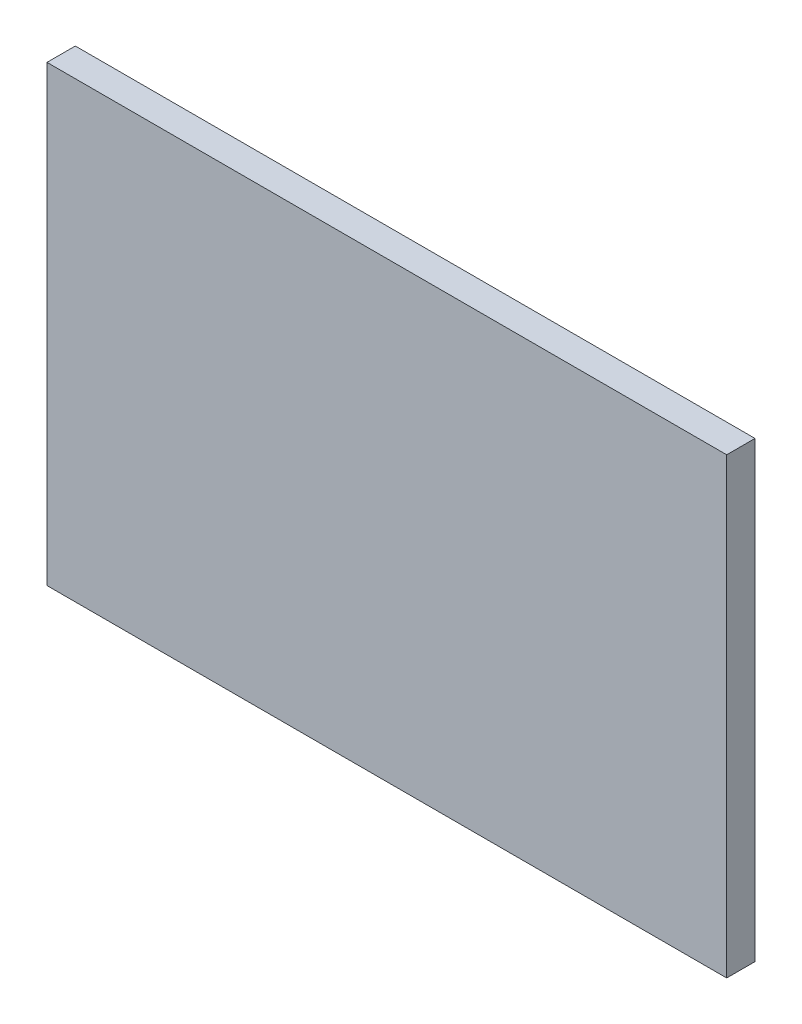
ISO-10303-21;
HEADER;
FILE_DESCRIPTION(('STEP AP214'),'2;1');
FILE_NAME('part.step','',(''),(''),'','','');
FILE_SCHEMA(('AUTOMOTIVE_DESIGN { 1 0 10303 214 1 1 1 1 }'));
ENDSEC;
DATA;
#1=APPLICATION_CONTEXT('core data for automotive mechanical design processes');
#2=APPLICATION_PROTOCOL_DEFINITION('international standard','automotive_design',2000,#1);
#3=PRODUCT_CONTEXT('',#1,'mechanical');
#4=PRODUCT('Part','Part','',(#3));
#5=PRODUCT_RELATED_PRODUCT_CATEGORY('part','',(#4));
#6=PRODUCT_DEFINITION_FORMATION('','',#4);
#7=PRODUCT_DEFINITION_CONTEXT('part definition',#1,'design');
#8=PRODUCT_DEFINITION('design','',#6,#7);
#9=PRODUCT_DEFINITION_SHAPE('','',#8);
#10=(LENGTH_UNIT() NAMED_UNIT(*) SI_UNIT(.MILLI.,.METRE.));
#11=(NAMED_UNIT(*) PLANE_ANGLE_UNIT() SI_UNIT($,.RADIAN.));
#12=(NAMED_UNIT(*) SI_UNIT($,.STERADIAN.) SOLID_ANGLE_UNIT());
#13=UNCERTAINTY_MEASURE_WITH_UNIT(LENGTH_MEASURE(1.E-05),#10,'distance_accuracy_value','');
#14=(GEOMETRIC_REPRESENTATION_CONTEXT(3) GLOBAL_UNCERTAINTY_ASSIGNED_CONTEXT((#13)) GLOBAL_UNIT_ASSIGNED_CONTEXT((#10,
#11,#12)) REPRESENTATION_CONTEXT('',''));
#15=CARTESIAN_POINT('',(0.,0.,0.));
#16=DIRECTION('',(0.,0.,1.));
#17=DIRECTION('',(1.,0.,0.));
#18=AXIS2_PLACEMENT_3D('',#15,#16,#17);
#19=CARTESIAN_POINT('',(0.,0.,3.175));
#20=DIRECTION('',(-1.,0.,0.));
#21=DIRECTION('',(0.,-1.,0.));
#22=AXIS2_PLACEMENT_3D('',#19,#20,#21);
#23=PLANE('',#22);
#24=DIRECTION('',(0.,1.,0.));
#25=VECTOR('',#24,1.);
#26=CARTESIAN_POINT('',(0.,0.,0.));
#27=LINE('',#26,#25);
#28=CARTESIAN_POINT('',(0.,-50.8,0.));
#29=VERTEX_POINT('',#28);
#30=CARTESIAN_POINT('',(0.,0.,0.));
#31=VERTEX_POINT('',#30);
#32=EDGE_CURVE('E93',#29,#31,#27,.T.);
#33=ORIENTED_EDGE('',*,*,#32,.T.);
#34=DIRECTION('',(0.,0.,-1.));
#35=VECTOR('',#34,1.);
#36=CARTESIAN_POINT('',(0.,0.,3.175));
#37=LINE('',#36,#35);
#38=CARTESIAN_POINT('',(0.,0.,3.175));
#39=VERTEX_POINT('',#38);
#40=EDGE_CURVE('E11',#39,#31,#37,.T.);
#41=ORIENTED_EDGE('',*,*,#40,.F.);
#42=DIRECTION('',(0.,1.,0.));
#43=VECTOR('',#42,1.);
#44=CARTESIAN_POINT('',(0.,0.,3.175));
#45=LINE('',#44,#43);
#46=CARTESIAN_POINT('',(0.,-50.8,3.175));
#47=VERTEX_POINT('',#46);
#48=EDGE_CURVE('E81',#47,#39,#45,.T.);
#49=ORIENTED_EDGE('',*,*,#48,.F.);
#50=DIRECTION('',(0.,0.,-1.));
#51=VECTOR('',#50,1.);
#52=CARTESIAN_POINT('',(0.,-50.8,3.175));
#53=LINE('',#52,#51);
#54=EDGE_CURVE('E89',#47,#29,#53,.T.);
#55=ORIENTED_EDGE('',*,*,#54,.T.);
#56=EDGE_LOOP('',(#33,#41,#49,#55));
#57=FACE_BOUND('',#56,.T.);
#58=ADVANCED_FACE('F30',(#57),#23,.F.);
#59=CARTESIAN_POINT('',(0.,0.,3.175));
#60=DIRECTION('',(0.,-1.,0.));
#61=DIRECTION('',(1.,0.,0.));
#62=AXIS2_PLACEMENT_3D('',#59,#60,#61);
#63=PLANE('',#62);
#64=DIRECTION('',(-1.,0.,0.));
#65=VECTOR('',#64,1.);
#66=CARTESIAN_POINT('',(0.,0.,0.));
#67=LINE('',#66,#65);
#68=CARTESIAN_POINT('',(-76.2,0.,0.));
#69=VERTEX_POINT('',#68);
#70=EDGE_CURVE('E85',#31,#69,#67,.T.);
#71=ORIENTED_EDGE('',*,*,#70,.T.);
#72=DIRECTION('',(0.,0.,-1.));
#73=VECTOR('',#72,1.);
#74=CARTESIAN_POINT('',(-76.2,0.,3.175));
#75=LINE('',#74,#73);
#76=CARTESIAN_POINT('',(-76.2,0.,3.175));
#77=VERTEX_POINT('',#76);
#78=EDGE_CURVE('E38',#77,#69,#75,.T.);
#79=ORIENTED_EDGE('',*,*,#78,.F.);
#80=DIRECTION('',(-1.,0.,0.));
#81=VECTOR('',#80,1.);
#82=CARTESIAN_POINT('',(0.,0.,3.175));
#83=LINE('',#82,#81);
#84=EDGE_CURVE('E76',#39,#77,#83,.T.);
#85=ORIENTED_EDGE('',*,*,#84,.F.);
#86=ORIENTED_EDGE('',*,*,#40,.T.);
#87=EDGE_LOOP('',(#71,#79,#85,#86));
#88=FACE_BOUND('',#87,.T.);
#89=ADVANCED_FACE('F84',(#88),#63,.F.);
#90=CARTESIAN_POINT('',(-76.2,0.,3.175));
#91=DIRECTION('',(1.,0.,0.));
#92=DIRECTION('',(0.,0.,-1.));
#93=AXIS2_PLACEMENT_3D('',#90,#91,#92);
#94=PLANE('',#93);
#95=DIRECTION('',(0.,-1.,0.));
#96=VECTOR('',#95,1.);
#97=CARTESIAN_POINT('',(-76.2,0.,0.));
#98=LINE('',#97,#96);
#99=CARTESIAN_POINT('',(-76.2,-50.8,0.));
#100=VERTEX_POINT('',#99);
#101=EDGE_CURVE('E63',#69,#100,#98,.T.);
#102=ORIENTED_EDGE('',*,*,#101,.T.);
#103=DIRECTION('',(0.,0.,-1.));
#104=VECTOR('',#103,1.);
#105=CARTESIAN_POINT('',(-76.2,-50.8,3.175));
#106=LINE('',#105,#104);
#107=CARTESIAN_POINT('',(-76.2,-50.8,3.175));
#108=VERTEX_POINT('',#107);
#109=EDGE_CURVE('E86',#108,#100,#106,.T.);
#110=ORIENTED_EDGE('',*,*,#109,.F.);
#111=DIRECTION('',(0.,-1.,0.));
#112=VECTOR('',#111,1.);
#113=CARTESIAN_POINT('',(-76.2,0.,3.175));
#114=LINE('',#113,#112);
#115=EDGE_CURVE('E79',#77,#108,#114,.T.);
#116=ORIENTED_EDGE('',*,*,#115,.F.);
#117=ORIENTED_EDGE('',*,*,#78,.T.);
#118=EDGE_LOOP('',(#102,#110,#116,#117));
#119=FACE_BOUND('',#118,.T.);
#120=ADVANCED_FACE('F87',(#119),#94,.F.);
#121=CARTESIAN_POINT('',(0.,-50.8,3.175));
#122=DIRECTION('',(0.,1.,0.));
#123=DIRECTION('',(-1.,0.,0.));
#124=AXIS2_PLACEMENT_3D('',#121,#122,#123);
#125=PLANE('',#124);
#126=DIRECTION('',(1.,0.,0.));
#127=VECTOR('',#126,1.);
#128=CARTESIAN_POINT('',(0.,-50.8,0.));
#129=LINE('',#128,#127);
#130=EDGE_CURVE('E69',#100,#29,#129,.T.);
#131=ORIENTED_EDGE('',*,*,#130,.T.);
#132=ORIENTED_EDGE('',*,*,#54,.F.);
#133=DIRECTION('',(1.,0.,0.));
#134=VECTOR('',#133,1.);
#135=CARTESIAN_POINT('',(0.,-50.8,3.175));
#136=LINE('',#135,#134);
#137=EDGE_CURVE('E46',#108,#47,#136,.T.);
#138=ORIENTED_EDGE('',*,*,#137,.F.);
#139=ORIENTED_EDGE('',*,*,#109,.T.);
#140=EDGE_LOOP('',(#131,#132,#138,#139));
#141=FACE_BOUND('',#140,.T.);
#142=ADVANCED_FACE('F100',(#141),#125,.F.);
#143=CARTESIAN_POINT('',(0.,-50.8,3.175));
#144=DIRECTION('',(0.,0.,-1.));
#145=DIRECTION('',(-1.,0.,0.));
#146=AXIS2_PLACEMENT_3D('',#143,#144,#145);
#147=PLANE('',#146);
#148=ORIENTED_EDGE('',*,*,#48,.T.);
#149=ORIENTED_EDGE('',*,*,#84,.T.);
#150=ORIENTED_EDGE('',*,*,#115,.T.);
#151=ORIENTED_EDGE('',*,*,#137,.T.);
#152=EDGE_LOOP('',(#148,#149,#150,#151));
#153=FACE_BOUND('',#152,.T.);
#154=ADVANCED_FACE('F77',(#153),#147,.F.);
#155=CARTESIAN_POINT('',(0.,-50.8,0.));
#156=DIRECTION('',(0.,0.,-1.));
#157=DIRECTION('',(-1.,0.,0.));
#158=AXIS2_PLACEMENT_3D('',#155,#156,#157);
#159=PLANE('',#158);
#160=ORIENTED_EDGE('',*,*,#32,.F.);
#161=ORIENTED_EDGE('',*,*,#130,.F.);
#162=ORIENTED_EDGE('',*,*,#101,.F.);
#163=ORIENTED_EDGE('',*,*,#70,.F.);
#164=EDGE_LOOP('',(#160,#161,#162,#163));
#165=FACE_BOUND('',#164,.T.);
#166=ADVANCED_FACE('F103',(#165),#159,.T.);
#167=CLOSED_SHELL('',(#58,#89,#120,#142,#154,#166));
#168=MANIFOLD_SOLID_BREP('B2',#167);
#169=ADVANCED_BREP_SHAPE_REPRESENTATION('',(#18,#168),#14);
#170=SHAPE_DEFINITION_REPRESENTATION(#9,#169);
ENDSEC;
END-ISO-10303-21;
